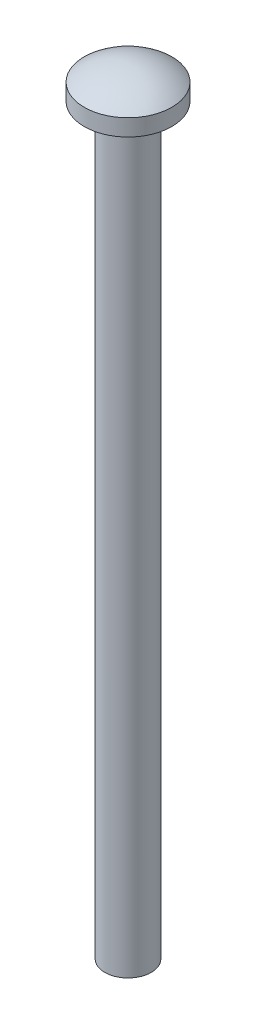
from build123d import *

# Parameters (mm, degrees)
SKETCH2_R           = 3.175
BOSS_EXTRUDE1_DEPTH = 101.6


with BuildPart() as part:
    # Sketch1 → Revolve1 (revolve)
    with BuildSketch(Plane.XY):
        with BuildLine():
            Line((0, 0), (0, 4.445))
            ThreePointArc((0, 4.445), (3.185675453, 3.888796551), (5.9944, 2.286))
            Line((5.9944, 2.286), (5.9944, 0))
            Line((5.9944, 0), (0, 0))
        make_face()
    revolve(axis=Axis((0, 0, 0), (0, 1, 0)))

    # Sketch2 → Boss-Extrude1 (add)
    with BuildSketch(Plane(origin=(0, 0, 0), x_dir=(1, 0, 0), z_dir=(0, 1, 0))):
        with Locations(Location((0, 0, 0), (0, 0, 270))):
            Circle(SKETCH2_R)
    extrude(amount=-BOSS_EXTRUDE1_DEPTH)


solid = part.part
